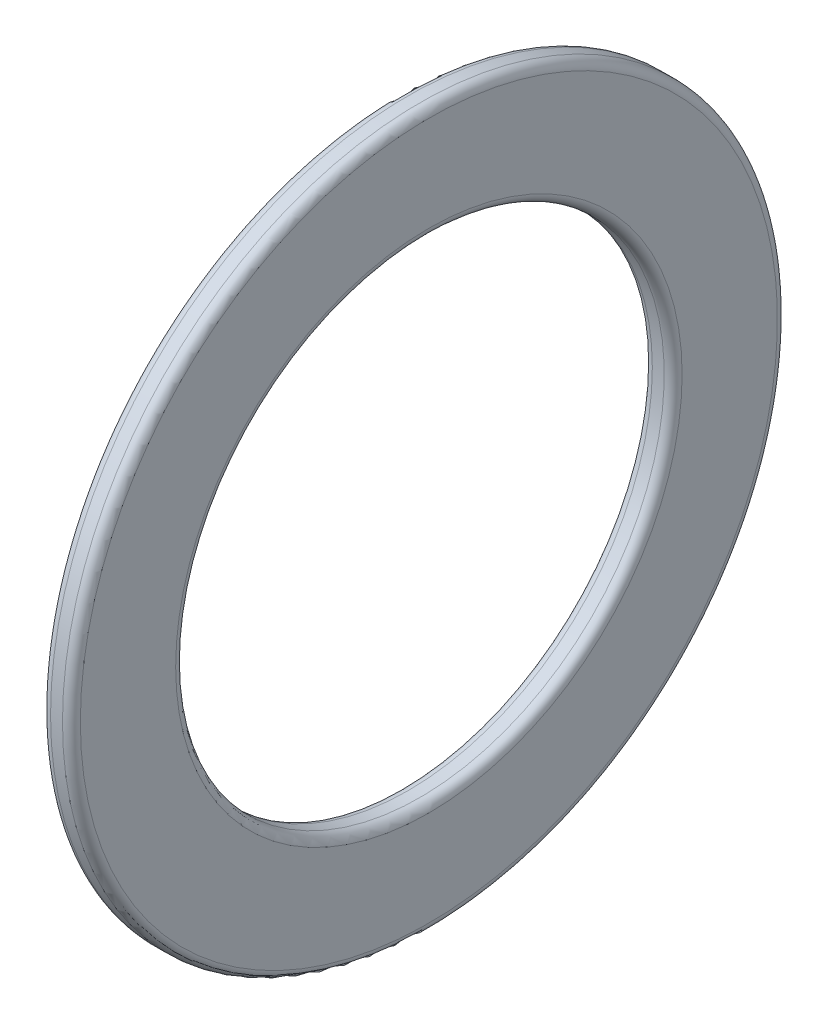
from build123d import *

# Parameters (mm, degrees)
ESQUISSE1_W = 1
ESQUISSE1_H = 3.8
CONG_1_R    = 0.3


with BuildPart() as part:
    # Esquisse1 → Base-R_volution (revolve)
    with BuildSketch(Plane.XY, mode=Mode.PRIVATE) as base_r_volution_sk:
        with Locations((-0.5, 10.1)):
            Rectangle(ESQUISSE1_W, ESQUISSE1_H)
    revolve(base_r_volution_sk.sketch.rotate(Axis((-50, 0, 0), (1, 0, 0)), 90), axis=Axis((-50, 0, 0), (1, 0, 0)))

    # Cong_1
    cong_1_edges = [part.edges().sort_by_distance(p)[0] for p in [
        (-1, 0, -8.2),
        (0, 0, -8.2),
        (0, 0, -12),
        (-1, 0, -12),
    ]]
    fillet(cong_1_edges, radius=CONG_1_R)


solid = part.part
